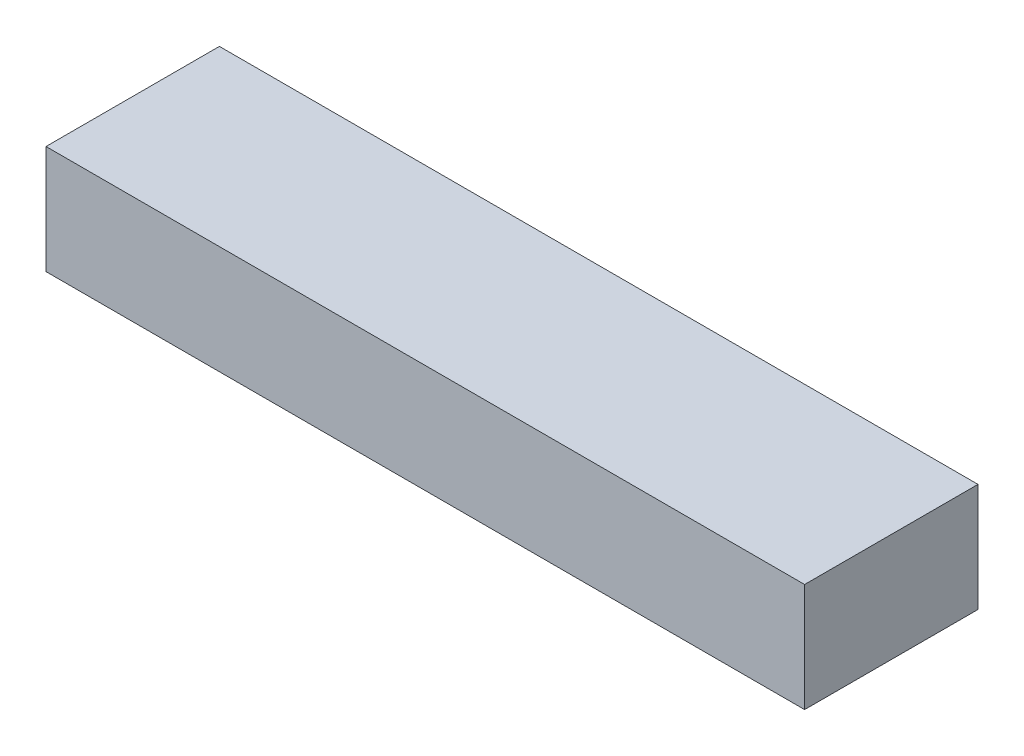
ISO-10303-21;
HEADER;
FILE_DESCRIPTION(('STEP AP214'),'2;1');
FILE_NAME('part.step','',(''),(''),'','','');
FILE_SCHEMA(('AUTOMOTIVE_DESIGN { 1 0 10303 214 1 1 1 1 }'));
ENDSEC;
DATA;
#1=APPLICATION_CONTEXT('core data for automotive mechanical design processes');
#2=APPLICATION_PROTOCOL_DEFINITION('international standard','automotive_design',2000,#1);
#3=PRODUCT_CONTEXT('',#1,'mechanical');
#4=PRODUCT('Part','Part','',(#3));
#5=PRODUCT_RELATED_PRODUCT_CATEGORY('part','',(#4));
#6=PRODUCT_DEFINITION_FORMATION('','',#4);
#7=PRODUCT_DEFINITION_CONTEXT('part definition',#1,'design');
#8=PRODUCT_DEFINITION('design','',#6,#7);
#9=PRODUCT_DEFINITION_SHAPE('','',#8);
#10=(LENGTH_UNIT() NAMED_UNIT(*) SI_UNIT(.MILLI.,.METRE.));
#11=(NAMED_UNIT(*) PLANE_ANGLE_UNIT() SI_UNIT($,.RADIAN.));
#12=(NAMED_UNIT(*) SI_UNIT($,.STERADIAN.) SOLID_ANGLE_UNIT());
#13=UNCERTAINTY_MEASURE_WITH_UNIT(LENGTH_MEASURE(1.E-05),#10,'distance_accuracy_value','');
#14=(GEOMETRIC_REPRESENTATION_CONTEXT(3) GLOBAL_UNCERTAINTY_ASSIGNED_CONTEXT((#13)) GLOBAL_UNIT_ASSIGNED_CONTEXT((#10,
#11,#12)) REPRESENTATION_CONTEXT('',''));
#15=CARTESIAN_POINT('',(0.,0.,0.));
#16=DIRECTION('',(0.,0.,1.));
#17=DIRECTION('',(1.,0.,0.));
#18=AXIS2_PLACEMENT_3D('',#15,#16,#17);
#19=CARTESIAN_POINT('',(0.,0.,8.));
#20=DIRECTION('',(1.,0.,0.));
#21=DIRECTION('',(0.,0.,-1.));
#22=AXIS2_PLACEMENT_3D('',#19,#20,#21);
#23=PLANE('',#22);
#24=DIRECTION('',(0.,-1.,0.));
#25=VECTOR('',#24,1.);
#26=CARTESIAN_POINT('',(0.,0.,0.));
#27=LINE('',#26,#25);
#28=CARTESIAN_POINT('',(0.,5.,0.));
#29=VERTEX_POINT('',#28);
#30=CARTESIAN_POINT('',(0.,0.,0.));
#31=VERTEX_POINT('',#30);
#32=EDGE_CURVE('E94',#29,#31,#27,.T.);
#33=ORIENTED_EDGE('',*,*,#32,.T.);
#34=DIRECTION('',(0.,0.,-1.));
#35=VECTOR('',#34,1.);
#36=CARTESIAN_POINT('',(0.,0.,8.));
#37=LINE('',#36,#35);
#38=CARTESIAN_POINT('',(0.,0.,8.));
#39=VERTEX_POINT('',#38);
#40=EDGE_CURVE('E11',#39,#31,#37,.T.);
#41=ORIENTED_EDGE('',*,*,#40,.F.);
#42=DIRECTION('',(0.,-1.,0.));
#43=VECTOR('',#42,1.);
#44=CARTESIAN_POINT('',(0.,0.,8.));
#45=LINE('',#44,#43);
#46=CARTESIAN_POINT('',(0.,5.,8.));
#47=VERTEX_POINT('',#46);
#48=EDGE_CURVE('E82',#47,#39,#45,.T.);
#49=ORIENTED_EDGE('',*,*,#48,.F.);
#50=DIRECTION('',(0.,0.,-1.));
#51=VECTOR('',#50,1.);
#52=CARTESIAN_POINT('',(0.,5.,8.));
#53=LINE('',#52,#51);
#54=EDGE_CURVE('E90',#47,#29,#53,.T.);
#55=ORIENTED_EDGE('',*,*,#54,.T.);
#56=EDGE_LOOP('',(#33,#41,#49,#55));
#57=FACE_BOUND('',#56,.T.);
#58=ADVANCED_FACE('F31',(#57),#23,.F.);
#59=CARTESIAN_POINT('',(0.,0.,8.));
#60=DIRECTION('',(0.,1.,0.));
#61=DIRECTION('',(0.,0.,1.));
#62=AXIS2_PLACEMENT_3D('',#59,#60,#61);
#63=PLANE('',#62);
#64=DIRECTION('',(1.,0.,0.));
#65=VECTOR('',#64,1.);
#66=CARTESIAN_POINT('',(0.,0.,0.));
#67=LINE('',#66,#65);
#68=CARTESIAN_POINT('',(35.,0.,0.));
#69=VERTEX_POINT('',#68);
#70=EDGE_CURVE('E86',#31,#69,#67,.T.);
#71=ORIENTED_EDGE('',*,*,#70,.T.);
#72=DIRECTION('',(0.,0.,-1.));
#73=VECTOR('',#72,1.);
#74=CARTESIAN_POINT('',(35.,0.,8.));
#75=LINE('',#74,#73);
#76=CARTESIAN_POINT('',(35.,0.,8.));
#77=VERTEX_POINT('',#76);
#78=EDGE_CURVE('E39',#77,#69,#75,.T.);
#79=ORIENTED_EDGE('',*,*,#78,.F.);
#80=DIRECTION('',(1.,0.,0.));
#81=VECTOR('',#80,1.);
#82=CARTESIAN_POINT('',(0.,0.,8.));
#83=LINE('',#82,#81);
#84=EDGE_CURVE('E77',#39,#77,#83,.T.);
#85=ORIENTED_EDGE('',*,*,#84,.F.);
#86=ORIENTED_EDGE('',*,*,#40,.T.);
#87=EDGE_LOOP('',(#71,#79,#85,#86));
#88=FACE_BOUND('',#87,.T.);
#89=ADVANCED_FACE('F85',(#88),#63,.F.);
#90=CARTESIAN_POINT('',(35.,0.,8.));
#91=DIRECTION('',(-1.,0.,0.));
#92=DIRECTION('',(0.,0.,1.));
#93=AXIS2_PLACEMENT_3D('',#90,#91,#92);
#94=PLANE('',#93);
#95=DIRECTION('',(0.,1.,0.));
#96=VECTOR('',#95,1.);
#97=CARTESIAN_POINT('',(35.,0.,0.));
#98=LINE('',#97,#96);
#99=CARTESIAN_POINT('',(35.,5.,0.));
#100=VERTEX_POINT('',#99);
#101=EDGE_CURVE('E64',#69,#100,#98,.T.);
#102=ORIENTED_EDGE('',*,*,#101,.T.);
#103=DIRECTION('',(0.,0.,-1.));
#104=VECTOR('',#103,1.);
#105=CARTESIAN_POINT('',(35.,5.,8.));
#106=LINE('',#105,#104);
#107=CARTESIAN_POINT('',(35.,5.,8.));
#108=VERTEX_POINT('',#107);
#109=EDGE_CURVE('E87',#108,#100,#106,.T.);
#110=ORIENTED_EDGE('',*,*,#109,.F.);
#111=DIRECTION('',(0.,1.,0.));
#112=VECTOR('',#111,1.);
#113=CARTESIAN_POINT('',(35.,0.,8.));
#114=LINE('',#113,#112);
#115=EDGE_CURVE('E80',#77,#108,#114,.T.);
#116=ORIENTED_EDGE('',*,*,#115,.F.);
#117=ORIENTED_EDGE('',*,*,#78,.T.);
#118=EDGE_LOOP('',(#102,#110,#116,#117));
#119=FACE_BOUND('',#118,.T.);
#120=ADVANCED_FACE('F88',(#119),#94,.F.);
#121=CARTESIAN_POINT('',(0.,5.,8.));
#122=DIRECTION('',(0.,-1.,0.));
#123=DIRECTION('',(0.,0.,-1.));
#124=AXIS2_PLACEMENT_3D('',#121,#122,#123);
#125=PLANE('',#124);
#126=DIRECTION('',(-1.,0.,0.));
#127=VECTOR('',#126,1.);
#128=CARTESIAN_POINT('',(0.,5.,0.));
#129=LINE('',#128,#127);
#130=EDGE_CURVE('E70',#100,#29,#129,.T.);
#131=ORIENTED_EDGE('',*,*,#130,.T.);
#132=ORIENTED_EDGE('',*,*,#54,.F.);
#133=DIRECTION('',(-1.,0.,0.));
#134=VECTOR('',#133,1.);
#135=CARTESIAN_POINT('',(0.,5.,8.));
#136=LINE('',#135,#134);
#137=EDGE_CURVE('E47',#108,#47,#136,.T.);
#138=ORIENTED_EDGE('',*,*,#137,.F.);
#139=ORIENTED_EDGE('',*,*,#109,.T.);
#140=EDGE_LOOP('',(#131,#132,#138,#139));
#141=FACE_BOUND('',#140,.T.);
#142=ADVANCED_FACE('F101',(#141),#125,.F.);
#143=CARTESIAN_POINT('',(0.,5.,8.));
#144=DIRECTION('',(0.,0.,-1.));
#145=DIRECTION('',(-1.,0.,0.));
#146=AXIS2_PLACEMENT_3D('',#143,#144,#145);
#147=PLANE('',#146);
#148=ORIENTED_EDGE('',*,*,#48,.T.);
#149=ORIENTED_EDGE('',*,*,#84,.T.);
#150=ORIENTED_EDGE('',*,*,#115,.T.);
#151=ORIENTED_EDGE('',*,*,#137,.T.);
#152=EDGE_LOOP('',(#148,#149,#150,#151));
#153=FACE_BOUND('',#152,.T.);
#154=ADVANCED_FACE('F78',(#153),#147,.F.);
#155=CARTESIAN_POINT('',(0.,5.,0.));
#156=DIRECTION('',(0.,0.,-1.));
#157=DIRECTION('',(-1.,0.,0.));
#158=AXIS2_PLACEMENT_3D('',#155,#156,#157);
#159=PLANE('',#158);
#160=ORIENTED_EDGE('',*,*,#32,.F.);
#161=ORIENTED_EDGE('',*,*,#130,.F.);
#162=ORIENTED_EDGE('',*,*,#101,.F.);
#163=ORIENTED_EDGE('',*,*,#70,.F.);
#164=EDGE_LOOP('',(#160,#161,#162,#163));
#165=FACE_BOUND('',#164,.T.);
#166=ADVANCED_FACE('F104',(#165),#159,.T.);
#167=CLOSED_SHELL('',(#58,#89,#120,#142,#154,#166));
#168=MANIFOLD_SOLID_BREP('B2',#167);
#169=ADVANCED_BREP_SHAPE_REPRESENTATION('',(#18,#168),#14);
#170=SHAPE_DEFINITION_REPRESENTATION(#9,#169);
ENDSEC;
END-ISO-10303-21;
